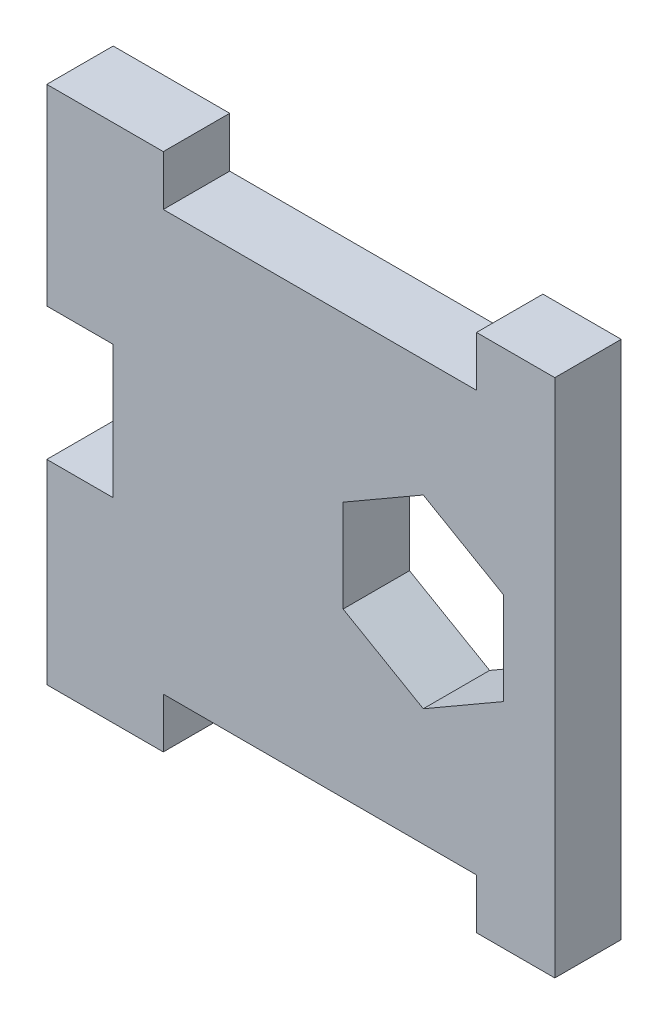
ISO-10303-21;
HEADER;
FILE_DESCRIPTION(('STEP AP214'),'2;1');
FILE_NAME('part.step','',(''),(''),'','','');
FILE_SCHEMA(('AUTOMOTIVE_DESIGN { 1 0 10303 214 1 1 1 1 }'));
ENDSEC;
DATA;
#1=APPLICATION_CONTEXT('core data for automotive mechanical design processes');
#2=APPLICATION_PROTOCOL_DEFINITION('international standard','automotive_design',2000,#1);
#3=PRODUCT_CONTEXT('',#1,'mechanical');
#4=PRODUCT('Part','Part','',(#3));
#5=PRODUCT_RELATED_PRODUCT_CATEGORY('part','',(#4));
#6=PRODUCT_DEFINITION_FORMATION('','',#4);
#7=PRODUCT_DEFINITION_CONTEXT('part definition',#1,'design');
#8=PRODUCT_DEFINITION('design','',#6,#7);
#9=PRODUCT_DEFINITION_SHAPE('','',#8);
#10=(LENGTH_UNIT() NAMED_UNIT(*) SI_UNIT(.MILLI.,.METRE.));
#11=(NAMED_UNIT(*) PLANE_ANGLE_UNIT() SI_UNIT($,.RADIAN.));
#12=(NAMED_UNIT(*) SI_UNIT($,.STERADIAN.) SOLID_ANGLE_UNIT());
#13=UNCERTAINTY_MEASURE_WITH_UNIT(LENGTH_MEASURE(1.E-05),#10,'distance_accuracy_value','');
#14=(GEOMETRIC_REPRESENTATION_CONTEXT(3) GLOBAL_UNCERTAINTY_ASSIGNED_CONTEXT((#13)) GLOBAL_UNIT_ASSIGNED_CONTEXT((#10,
#11,#12)) REPRESENTATION_CONTEXT('',''));
#15=CARTESIAN_POINT('',(0.,0.,0.));
#16=DIRECTION('',(0.,0.,1.));
#17=DIRECTION('',(1.,0.,0.));
#18=AXIS2_PLACEMENT_3D('',#15,#16,#17);
#19=CARTESIAN_POINT('',(0.,-739.302548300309,-1.8126327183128));
#20=DIRECTION('',(0.,1.,0.));
#21=DIRECTION('',(0.,0.,1.));
#22=AXIS2_PLACEMENT_3D('',#19,#20,#21);
#23=PLANE('',#22);
#24=DIRECTION('',(1.,0.,0.));
#25=VECTOR('',#24,1.);
#26=CARTESIAN_POINT('',(0.,-739.302548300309,-7.1974327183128));
#27=LINE('',#26,#25);
#28=CARTESIAN_POINT('',(598.468256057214,-739.302548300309,-7.1974327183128));
#29=VERTEX_POINT('',#28);
#30=CARTESIAN_POINT('',(607.917056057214,-739.302548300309,-7.1974327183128));
#31=VERTEX_POINT('',#30);
#32=EDGE_CURVE('E238',#29,#31,#27,.T.);
#33=ORIENTED_EDGE('',*,*,#32,.T.);
#34=DIRECTION('',(0.,0.,-1.));
#35=VECTOR('',#34,1.);
#36=CARTESIAN_POINT('',(607.917056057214,-739.302548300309,-1.8126327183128));
#37=LINE('',#36,#35);
#38=CARTESIAN_POINT('',(607.917056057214,-739.302548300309,-1.8126327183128));
#39=VERTEX_POINT('',#38);
#40=EDGE_CURVE('E11',#39,#31,#37,.T.);
#41=ORIENTED_EDGE('',*,*,#40,.F.);
#42=DIRECTION('',(1.,0.,0.));
#43=VECTOR('',#42,1.);
#44=CARTESIAN_POINT('',(0.,-739.302548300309,-1.8126327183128));
#45=LINE('',#44,#43);
#46=CARTESIAN_POINT('',(598.468256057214,-739.302548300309,-1.8126327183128));
#47=VERTEX_POINT('',#46);
#48=EDGE_CURVE('E347',#47,#39,#45,.T.);
#49=ORIENTED_EDGE('',*,*,#48,.F.);
#50=DIRECTION('',(0.,0.,-1.));
#51=VECTOR('',#50,1.);
#52=CARTESIAN_POINT('',(598.468256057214,-739.302548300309,-1.8126327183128));
#53=LINE('',#52,#51);
#54=EDGE_CURVE('E273',#47,#29,#53,.T.);
#55=ORIENTED_EDGE('',*,*,#54,.T.);
#56=EDGE_LOOP('',(#33,#41,#49,#55));
#57=FACE_BOUND('',#56,.T.);
#58=ADVANCED_FACE('F34',(#57),#23,.F.);
#59=CARTESIAN_POINT('',(607.917056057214,0.,-1.8126327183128));
#60=DIRECTION('',(-1.,0.,0.));
#61=DIRECTION('',(0.,0.,1.));
#62=AXIS2_PLACEMENT_3D('',#59,#60,#61);
#63=PLANE('',#62);
#64=DIRECTION('',(0.,1.,0.));
#65=VECTOR('',#64,1.);
#66=CARTESIAN_POINT('',(607.917056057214,0.,-7.1974327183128));
#67=LINE('',#66,#65);
#68=CARTESIAN_POINT('',(607.917056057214,-735.238548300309,-7.1974327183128));
#69=VERTEX_POINT('',#68);
#70=EDGE_CURVE('E241',#31,#69,#67,.T.);
#71=ORIENTED_EDGE('',*,*,#70,.T.);
#72=DIRECTION('',(0.,0.,-1.));
#73=VECTOR('',#72,1.);
#74=CARTESIAN_POINT('',(607.917056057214,-735.238548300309,-1.8126327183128));
#75=LINE('',#74,#73);
#76=CARTESIAN_POINT('',(607.917056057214,-735.238548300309,-1.8126327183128));
#77=VERTEX_POINT('',#76);
#78=EDGE_CURVE('E44',#77,#69,#75,.T.);
#79=ORIENTED_EDGE('',*,*,#78,.F.);
#80=DIRECTION('',(0.,1.,0.));
#81=VECTOR('',#80,1.);
#82=CARTESIAN_POINT('',(607.917056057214,0.,-1.8126327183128));
#83=LINE('',#82,#81);
#84=EDGE_CURVE('E349',#39,#77,#83,.T.);
#85=ORIENTED_EDGE('',*,*,#84,.F.);
#86=ORIENTED_EDGE('',*,*,#40,.T.);
#87=EDGE_LOOP('',(#71,#79,#85,#86));
#88=FACE_BOUND('',#87,.T.);
#89=ADVANCED_FACE('F398',(#88),#63,.F.);
#90=CARTESIAN_POINT('',(0.,-735.238548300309,-1.8126327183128));
#91=DIRECTION('',(0.,1.,0.));
#92=DIRECTION('',(0.,0.,1.));
#93=AXIS2_PLACEMENT_3D('',#90,#91,#92);
#94=PLANE('',#93);
#95=DIRECTION('',(1.,0.,0.));
#96=VECTOR('',#95,1.);
#97=CARTESIAN_POINT('',(0.,-735.238548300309,-7.1974327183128));
#98=LINE('',#97,#96);
#99=CARTESIAN_POINT('',(633.317056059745,-735.238548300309,-7.1974327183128));
#100=VERTEX_POINT('',#99);
#101=EDGE_CURVE('E243',#69,#100,#98,.T.);
#102=ORIENTED_EDGE('',*,*,#101,.T.);
#103=DIRECTION('',(0.,0.,-1.));
#104=VECTOR('',#103,1.);
#105=CARTESIAN_POINT('',(633.317056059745,-735.238548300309,-1.8126327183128));
#106=LINE('',#105,#104);
#107=CARTESIAN_POINT('',(633.317056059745,-735.238548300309,-1.8126327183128));
#108=VERTEX_POINT('',#107);
#109=EDGE_CURVE('E301',#108,#100,#106,.T.);
#110=ORIENTED_EDGE('',*,*,#109,.F.);
#111=DIRECTION('',(1.,0.,0.));
#112=VECTOR('',#111,1.);
#113=CARTESIAN_POINT('',(0.,-735.238548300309,-1.8126327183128));
#114=LINE('',#113,#112);
#115=EDGE_CURVE('E351',#77,#108,#114,.T.);
#116=ORIENTED_EDGE('',*,*,#115,.F.);
#117=ORIENTED_EDGE('',*,*,#78,.T.);
#118=EDGE_LOOP('',(#102,#110,#116,#117));
#119=FACE_BOUND('',#118,.T.);
#120=ADVANCED_FACE('F403',(#119),#94,.F.);
#121=CARTESIAN_POINT('',(633.317056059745,0.,-1.8126327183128));
#122=DIRECTION('',(1.,0.,0.));
#123=DIRECTION('',(0.,0.,-1.));
#124=AXIS2_PLACEMENT_3D('',#121,#122,#123);
#125=PLANE('',#124);
#126=DIRECTION('',(0.,-1.,0.));
#127=VECTOR('',#126,1.);
#128=CARTESIAN_POINT('',(633.317056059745,0.,-7.1974327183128));
#129=LINE('',#128,#127);
#130=CARTESIAN_POINT('',(633.317056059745,-739.302548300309,-7.1974327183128));
#131=VERTEX_POINT('',#130);
#132=EDGE_CURVE('E245',#100,#131,#129,.T.);
#133=ORIENTED_EDGE('',*,*,#132,.T.);
#134=DIRECTION('',(0.,0.,-1.));
#135=VECTOR('',#134,1.);
#136=CARTESIAN_POINT('',(633.317056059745,-739.302548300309,-1.8126327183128));
#137=LINE('',#136,#135);
#138=CARTESIAN_POINT('',(633.317056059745,-739.302548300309,-1.8126327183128));
#139=VERTEX_POINT('',#138);
#140=EDGE_CURVE('E298',#139,#131,#137,.T.);
#141=ORIENTED_EDGE('',*,*,#140,.F.);
#142=DIRECTION('',(0.,-1.,0.));
#143=VECTOR('',#142,1.);
#144=CARTESIAN_POINT('',(633.317056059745,0.,-1.8126327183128));
#145=LINE('',#144,#143);
#146=EDGE_CURVE('E353',#108,#139,#145,.T.);
#147=ORIENTED_EDGE('',*,*,#146,.F.);
#148=ORIENTED_EDGE('',*,*,#109,.T.);
#149=EDGE_LOOP('',(#133,#141,#147,#148));
#150=FACE_BOUND('',#149,.T.);
#151=ADVANCED_FACE('F457',(#150),#125,.F.);
#152=CARTESIAN_POINT('',(0.,-739.302548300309,-1.8126327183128));
#153=DIRECTION('',(0.,1.,0.));
#154=DIRECTION('',(0.,0.,1.));
#155=AXIS2_PLACEMENT_3D('',#152,#153,#154);
#156=PLANE('',#155);
#157=DIRECTION('',(1.,0.,0.));
#158=VECTOR('',#157,1.);
#159=CARTESIAN_POINT('',(0.,-739.302548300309,-7.1974327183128));
#160=LINE('',#159,#158);
#161=CARTESIAN_POINT('',(639.667056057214,-739.302548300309,-7.1974327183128));
#162=VERTEX_POINT('',#161);
#163=EDGE_CURVE('E247',#131,#162,#160,.T.);
#164=ORIENTED_EDGE('',*,*,#163,.T.);
#165=DIRECTION('',(0.,0.,-1.));
#166=VECTOR('',#165,1.);
#167=CARTESIAN_POINT('',(639.667056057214,-739.302548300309,-1.8126327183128));
#168=LINE('',#167,#166);
#169=CARTESIAN_POINT('',(639.667056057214,-739.302548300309,-1.8126327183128));
#170=VERTEX_POINT('',#169);
#171=EDGE_CURVE('E295',#170,#162,#168,.T.);
#172=ORIENTED_EDGE('',*,*,#171,.F.);
#173=DIRECTION('',(1.,0.,0.));
#174=VECTOR('',#173,1.);
#175=CARTESIAN_POINT('',(0.,-739.302548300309,-1.8126327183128));
#176=LINE('',#175,#174);
#177=EDGE_CURVE('E355',#139,#170,#176,.T.);
#178=ORIENTED_EDGE('',*,*,#177,.F.);
#179=ORIENTED_EDGE('',*,*,#140,.T.);
#180=EDGE_LOOP('',(#164,#172,#178,#179));
#181=FACE_BOUND('',#180,.T.);
#182=ADVANCED_FACE('F453',(#181),#156,.F.);
#183=CARTESIAN_POINT('',(639.667056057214,0.,-1.8126327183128));
#184=DIRECTION('',(-1.,0.,0.));
#185=DIRECTION('',(0.,0.,1.));
#186=AXIS2_PLACEMENT_3D('',#183,#184,#185);
#187=PLANE('',#186);
#188=DIRECTION('',(0.,1.,0.));
#189=VECTOR('',#188,1.);
#190=CARTESIAN_POINT('',(639.667056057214,0.,-7.1974327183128));
#191=LINE('',#190,#189);
#192=CARTESIAN_POINT('',(639.667056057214,-697.138548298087,-7.1974327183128));
#193=VERTEX_POINT('',#192);
#194=EDGE_CURVE('E249',#162,#193,#191,.T.);
#195=ORIENTED_EDGE('',*,*,#194,.T.);
#196=DIRECTION('',(0.,0.,-1.));
#197=VECTOR('',#196,1.);
#198=CARTESIAN_POINT('',(639.667056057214,-697.138548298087,-1.8126327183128));
#199=LINE('',#198,#197);
#200=CARTESIAN_POINT('',(639.667056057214,-697.138548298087,-1.8126327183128));
#201=VERTEX_POINT('',#200);
#202=EDGE_CURVE('E292',#201,#193,#199,.T.);
#203=ORIENTED_EDGE('',*,*,#202,.F.);
#204=DIRECTION('',(0.,1.,0.));
#205=VECTOR('',#204,1.);
#206=CARTESIAN_POINT('',(639.667056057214,0.,-1.8126327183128));
#207=LINE('',#206,#205);
#208=EDGE_CURVE('E357',#170,#201,#207,.T.);
#209=ORIENTED_EDGE('',*,*,#208,.F.);
#210=ORIENTED_EDGE('',*,*,#171,.T.);
#211=EDGE_LOOP('',(#195,#203,#209,#210));
#212=FACE_BOUND('',#211,.T.);
#213=ADVANCED_FACE('F449',(#212),#187,.F.);
#214=CARTESIAN_POINT('',(0.,-697.138548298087,-1.8126327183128));
#215=DIRECTION('',(0.,-1.,0.));
#216=DIRECTION('',(0.,0.,-1.));
#217=AXIS2_PLACEMENT_3D('',#214,#215,#216);
#218=PLANE('',#217);
#219=DIRECTION('',(-1.,0.,0.));
#220=VECTOR('',#219,1.);
#221=CARTESIAN_POINT('',(0.,-697.138548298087,-7.1974327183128));
#222=LINE('',#221,#220);
#223=CARTESIAN_POINT('',(633.317056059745,-697.138548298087,-7.1974327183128));
#224=VERTEX_POINT('',#223);
#225=EDGE_CURVE('E251',#193,#224,#222,.T.);
#226=ORIENTED_EDGE('',*,*,#225,.T.);
#227=DIRECTION('',(0.,0.,-1.));
#228=VECTOR('',#227,1.);
#229=CARTESIAN_POINT('',(633.317056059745,-697.138548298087,-1.8126327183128));
#230=LINE('',#229,#228);
#231=CARTESIAN_POINT('',(633.317056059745,-697.138548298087,-1.8126327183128));
#232=VERTEX_POINT('',#231);
#233=EDGE_CURVE('E289',#232,#224,#230,.T.);
#234=ORIENTED_EDGE('',*,*,#233,.F.);
#235=DIRECTION('',(-1.,0.,0.));
#236=VECTOR('',#235,1.);
#237=CARTESIAN_POINT('',(0.,-697.138548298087,-1.8126327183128));
#238=LINE('',#237,#236);
#239=EDGE_CURVE('E359',#201,#232,#238,.T.);
#240=ORIENTED_EDGE('',*,*,#239,.F.);
#241=ORIENTED_EDGE('',*,*,#202,.T.);
#242=EDGE_LOOP('',(#226,#234,#240,#241));
#243=FACE_BOUND('',#242,.T.);
#244=ADVANCED_FACE('F445',(#243),#218,.F.);
#245=CARTESIAN_POINT('',(633.317056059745,0.,-1.8126327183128));
#246=DIRECTION('',(1.,0.,0.));
#247=DIRECTION('',(0.,0.,-1.));
#248=AXIS2_PLACEMENT_3D('',#245,#246,#247);
#249=PLANE('',#248);
#250=DIRECTION('',(0.,-1.,0.));
#251=VECTOR('',#250,1.);
#252=CARTESIAN_POINT('',(633.317056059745,0.,-7.1974327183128));
#253=LINE('',#252,#251);
#254=CARTESIAN_POINT('',(633.317056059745,-701.202548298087,-7.1974327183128));
#255=VERTEX_POINT('',#254);
#256=EDGE_CURVE('E253',#224,#255,#253,.T.);
#257=ORIENTED_EDGE('',*,*,#256,.T.);
#258=DIRECTION('',(0.,0.,-1.));
#259=VECTOR('',#258,1.);
#260=CARTESIAN_POINT('',(633.317056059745,-701.202548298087,-1.8126327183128));
#261=LINE('',#260,#259);
#262=CARTESIAN_POINT('',(633.317056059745,-701.202548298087,-1.8126327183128));
#263=VERTEX_POINT('',#262);
#264=EDGE_CURVE('E286',#263,#255,#261,.T.);
#265=ORIENTED_EDGE('',*,*,#264,.F.);
#266=DIRECTION('',(0.,-1.,0.));
#267=VECTOR('',#266,1.);
#268=CARTESIAN_POINT('',(633.317056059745,0.,-1.8126327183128));
#269=LINE('',#268,#267);
#270=EDGE_CURVE('E361',#232,#263,#269,.T.);
#271=ORIENTED_EDGE('',*,*,#270,.F.);
#272=ORIENTED_EDGE('',*,*,#233,.T.);
#273=EDGE_LOOP('',(#257,#265,#271,#272));
#274=FACE_BOUND('',#273,.T.);
#275=ADVANCED_FACE('F441',(#274),#249,.F.);
#276=CARTESIAN_POINT('',(0.,-701.202548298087,-1.8126327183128));
#277=DIRECTION('',(0.,-1.,0.));
#278=DIRECTION('',(0.,0.,-1.));
#279=AXIS2_PLACEMENT_3D('',#276,#277,#278);
#280=PLANE('',#279);
#281=DIRECTION('',(-1.,0.,0.));
#282=VECTOR('',#281,1.);
#283=CARTESIAN_POINT('',(0.,-701.202548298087,-7.1974327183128));
#284=LINE('',#283,#282);
#285=CARTESIAN_POINT('',(607.917056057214,-701.202548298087,-7.1974327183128));
#286=VERTEX_POINT('',#285);
#287=EDGE_CURVE('E255',#255,#286,#284,.T.);
#288=ORIENTED_EDGE('',*,*,#287,.T.);
#289=DIRECTION('',(0.,0.,-1.));
#290=VECTOR('',#289,1.);
#291=CARTESIAN_POINT('',(607.917056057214,-701.202548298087,-1.8126327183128));
#292=LINE('',#291,#290);
#293=CARTESIAN_POINT('',(607.917056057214,-701.202548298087,-1.8126327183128));
#294=VERTEX_POINT('',#293);
#295=EDGE_CURVE('E283',#294,#286,#292,.T.);
#296=ORIENTED_EDGE('',*,*,#295,.F.);
#297=DIRECTION('',(-1.,0.,0.));
#298=VECTOR('',#297,1.);
#299=CARTESIAN_POINT('',(0.,-701.202548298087,-1.8126327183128));
#300=LINE('',#299,#298);
#301=EDGE_CURVE('E363',#263,#294,#300,.T.);
#302=ORIENTED_EDGE('',*,*,#301,.F.);
#303=ORIENTED_EDGE('',*,*,#264,.T.);
#304=EDGE_LOOP('',(#288,#296,#302,#303));
#305=FACE_BOUND('',#304,.T.);
#306=ADVANCED_FACE('F437',(#305),#280,.F.);
#307=CARTESIAN_POINT('',(607.917056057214,0.,-1.8126327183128));
#308=DIRECTION('',(-1.,0.,0.));
#309=DIRECTION('',(0.,0.,1.));
#310=AXIS2_PLACEMENT_3D('',#307,#308,#309);
#311=PLANE('',#310);
#312=DIRECTION('',(0.,1.,0.));
#313=VECTOR('',#312,1.);
#314=CARTESIAN_POINT('',(607.917056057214,0.,-7.1974327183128));
#315=LINE('',#314,#313);
#316=CARTESIAN_POINT('',(607.917056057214,-697.138548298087,-7.1974327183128));
#317=VERTEX_POINT('',#316);
#318=EDGE_CURVE('E257',#286,#317,#315,.T.);
#319=ORIENTED_EDGE('',*,*,#318,.T.);
#320=DIRECTION('',(0.,0.,-1.));
#321=VECTOR('',#320,1.);
#322=CARTESIAN_POINT('',(607.917056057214,-697.138548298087,-1.8126327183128));
#323=LINE('',#322,#321);
#324=CARTESIAN_POINT('',(607.917056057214,-697.138548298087,-1.8126327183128));
#325=VERTEX_POINT('',#324);
#326=EDGE_CURVE('E281',#325,#317,#323,.T.);
#327=ORIENTED_EDGE('',*,*,#326,.F.);
#328=DIRECTION('',(0.,1.,0.));
#329=VECTOR('',#328,1.);
#330=CARTESIAN_POINT('',(607.917056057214,0.,-1.8126327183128));
#331=LINE('',#330,#329);
#332=EDGE_CURVE('E365',#294,#325,#331,.T.);
#333=ORIENTED_EDGE('',*,*,#332,.F.);
#334=ORIENTED_EDGE('',*,*,#295,.T.);
#335=EDGE_LOOP('',(#319,#327,#333,#334));
#336=FACE_BOUND('',#335,.T.);
#337=ADVANCED_FACE('F433',(#336),#311,.F.);
#338=CARTESIAN_POINT('',(-1.96591127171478E-10,-697.138548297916,-1.8126327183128));
#339=DIRECTION('',(2.81997212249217E-13,1.,0.));
#340=DIRECTION('',(-1.,2.81997212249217E-13,0.));
#341=AXIS2_PLACEMENT_3D('',#338,#339,#340);
#342=PLANE('',#341);
#343=DIRECTION('',(1.,-2.81997212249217E-13,0.));
#344=VECTOR('',#343,1.);
#345=CARTESIAN_POINT('',(-1.96591127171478E-10,-697.138548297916,-7.1974327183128));
#346=LINE('',#345,#344);
#347=CARTESIAN_POINT('',(598.468256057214,-697.138548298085,-7.1974327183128));
#348=VERTEX_POINT('',#347);
#349=EDGE_CURVE('E260',#348,#317,#346,.T.);
#350=ORIENTED_EDGE('',*,*,#349,.F.);
#351=DIRECTION('',(0.,0.,-1.));
#352=VECTOR('',#351,1.);
#353=CARTESIAN_POINT('',(598.468256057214,-697.138548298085,-1.8126327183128));
#354=LINE('',#353,#352);
#355=CARTESIAN_POINT('',(598.468256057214,-697.138548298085,-1.8126327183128));
#356=VERTEX_POINT('',#355);
#357=EDGE_CURVE('E279',#356,#348,#354,.T.);
#358=ORIENTED_EDGE('',*,*,#357,.F.);
#359=DIRECTION('',(1.,-2.81997212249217E-13,0.));
#360=VECTOR('',#359,1.);
#361=CARTESIAN_POINT('',(-1.96591127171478E-10,-697.138548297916,-1.8126327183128));
#362=LINE('',#361,#360);
#363=EDGE_CURVE('E367',#356,#325,#362,.T.);
#364=ORIENTED_EDGE('',*,*,#363,.T.);
#365=ORIENTED_EDGE('',*,*,#326,.T.);
#366=EDGE_LOOP('',(#350,#358,#364,#365));
#367=FACE_BOUND('',#366,.T.);
#368=ADVANCED_FACE('F430',(#367),#342,.T.);
#369=CARTESIAN_POINT('',(598.468256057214,0.,-1.8126327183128));
#370=DIRECTION('',(-1.,0.,0.));
#371=DIRECTION('',(0.,0.,1.));
#372=AXIS2_PLACEMENT_3D('',#369,#370,#371);
#373=PLANE('',#372);
#374=DIRECTION('',(0.,1.,0.));
#375=VECTOR('',#374,1.);
#376=CARTESIAN_POINT('',(598.468256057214,0.,-7.1974327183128));
#377=LINE('',#376,#375);
#378=CARTESIAN_POINT('',(598.468256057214,-712.70874829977,-7.1974327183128));
#379=VERTEX_POINT('',#378);
#380=EDGE_CURVE('E263',#379,#348,#377,.T.);
#381=ORIENTED_EDGE('',*,*,#380,.F.);
#382=DIRECTION('',(0.,0.,-1.));
#383=VECTOR('',#382,1.);
#384=CARTESIAN_POINT('',(598.468256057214,-712.70874829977,-1.8126327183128));
#385=LINE('',#384,#383);
#386=CARTESIAN_POINT('',(598.468256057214,-712.70874829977,-1.8126327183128));
#387=VERTEX_POINT('',#386);
#388=EDGE_CURVE('E277',#387,#379,#385,.T.);
#389=ORIENTED_EDGE('',*,*,#388,.F.);
#390=DIRECTION('',(0.,1.,0.));
#391=VECTOR('',#390,1.);
#392=CARTESIAN_POINT('',(598.468256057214,0.,-1.8126327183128));
#393=LINE('',#392,#391);
#394=EDGE_CURVE('E214',#387,#356,#393,.T.);
#395=ORIENTED_EDGE('',*,*,#394,.T.);
#396=ORIENTED_EDGE('',*,*,#357,.T.);
#397=EDGE_LOOP('',(#381,#389,#395,#396));
#398=FACE_BOUND('',#397,.T.);
#399=ADVANCED_FACE('F372',(#398),#373,.T.);
#400=CARTESIAN_POINT('',(0.,-712.70874829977,-1.8126327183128));
#401=DIRECTION('',(0.,-1.,0.));
#402=DIRECTION('',(0.,0.,-1.));
#403=AXIS2_PLACEMENT_3D('',#400,#401,#402);
#404=PLANE('',#403);
#405=DIRECTION('',(-1.,0.,0.));
#406=VECTOR('',#405,1.);
#407=CARTESIAN_POINT('',(0.,-712.70874829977,-7.1974327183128));
#408=LINE('',#407,#406);
#409=CARTESIAN_POINT('',(603.853056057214,-712.70874829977,-7.1974327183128));
#410=VERTEX_POINT('',#409);
#411=EDGE_CURVE('E266',#410,#379,#408,.T.);
#412=ORIENTED_EDGE('',*,*,#411,.F.);
#413=DIRECTION('',(0.,0.,-1.));
#414=VECTOR('',#413,1.);
#415=CARTESIAN_POINT('',(603.853056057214,-712.70874829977,-1.8126327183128));
#416=LINE('',#415,#414);
#417=CARTESIAN_POINT('',(603.853056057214,-712.70874829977,-1.8126327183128));
#418=VERTEX_POINT('',#417);
#419=EDGE_CURVE('E202',#418,#410,#416,.T.);
#420=ORIENTED_EDGE('',*,*,#419,.F.);
#421=DIRECTION('',(-1.,0.,0.));
#422=VECTOR('',#421,1.);
#423=CARTESIAN_POINT('',(0.,-712.70874829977,-1.8126327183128));
#424=LINE('',#423,#422);
#425=EDGE_CURVE('E212',#418,#387,#424,.T.);
#426=ORIENTED_EDGE('',*,*,#425,.T.);
#427=ORIENTED_EDGE('',*,*,#388,.T.);
#428=EDGE_LOOP('',(#412,#420,#426,#427));
#429=FACE_BOUND('',#428,.T.);
#430=ADVANCED_FACE('F377',(#429),#404,.T.);
#431=CARTESIAN_POINT('',(603.853056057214,0.,-1.8126327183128));
#432=DIRECTION('',(-1.,0.,0.));
#433=DIRECTION('',(0.,0.,1.));
#434=AXIS2_PLACEMENT_3D('',#431,#432,#433);
#435=PLANE('',#434);
#436=DIRECTION('',(0.,1.,0.));
#437=VECTOR('',#436,1.);
#438=CARTESIAN_POINT('',(603.853056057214,0.,-7.1974327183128));
#439=LINE('',#438,#437);
#440=CARTESIAN_POINT('',(603.853056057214,-723.47834829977,-7.1974327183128));
#441=VERTEX_POINT('',#440);
#442=EDGE_CURVE('E201',#441,#410,#439,.T.);
#443=ORIENTED_EDGE('',*,*,#442,.F.);
#444=DIRECTION('',(0.,0.,-1.));
#445=VECTOR('',#444,1.);
#446=CARTESIAN_POINT('',(603.853056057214,-723.47834829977,-1.8126327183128));
#447=LINE('',#446,#445);
#448=CARTESIAN_POINT('',(603.853056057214,-723.47834829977,-1.8126327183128));
#449=VERTEX_POINT('',#448);
#450=EDGE_CURVE('E195',#449,#441,#447,.T.);
#451=ORIENTED_EDGE('',*,*,#450,.F.);
#452=DIRECTION('',(0.,1.,0.));
#453=VECTOR('',#452,1.);
#454=CARTESIAN_POINT('',(603.853056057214,0.,-1.8126327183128));
#455=LINE('',#454,#453);
#456=EDGE_CURVE('E199',#449,#418,#455,.T.);
#457=ORIENTED_EDGE('',*,*,#456,.T.);
#458=ORIENTED_EDGE('',*,*,#419,.T.);
#459=EDGE_LOOP('',(#443,#451,#457,#458));
#460=FACE_BOUND('',#459,.T.);
#461=ADVANCED_FACE('F197',(#460),#435,.T.);
#462=CARTESIAN_POINT('',(0.,-723.47834829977,-1.8126327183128));
#463=DIRECTION('',(0.,-1.,0.));
#464=DIRECTION('',(0.,0.,-1.));
#465=AXIS2_PLACEMENT_3D('',#462,#463,#464);
#466=PLANE('',#465);
#467=DIRECTION('',(-1.,0.,0.));
#468=VECTOR('',#467,1.);
#469=CARTESIAN_POINT('',(0.,-723.47834829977,-7.1974327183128));
#470=LINE('',#469,#468);
#471=CARTESIAN_POINT('',(598.468256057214,-723.47834829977,-7.1974327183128));
#472=VERTEX_POINT('',#471);
#473=EDGE_CURVE('E123',#441,#472,#470,.T.);
#474=ORIENTED_EDGE('',*,*,#473,.T.);
#475=DIRECTION('',(0.,0.,-1.));
#476=VECTOR('',#475,1.);
#477=CARTESIAN_POINT('',(598.468256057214,-723.47834829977,-1.8126327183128));
#478=LINE('',#477,#476);
#479=CARTESIAN_POINT('',(598.468256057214,-723.47834829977,-1.8126327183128));
#480=VERTEX_POINT('',#479);
#481=EDGE_CURVE('E203',#480,#472,#478,.T.);
#482=ORIENTED_EDGE('',*,*,#481,.F.);
#483=DIRECTION('',(-1.,0.,0.));
#484=VECTOR('',#483,1.);
#485=CARTESIAN_POINT('',(0.,-723.47834829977,-1.8126327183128));
#486=LINE('',#485,#484);
#487=EDGE_CURVE('E205',#449,#480,#486,.T.);
#488=ORIENTED_EDGE('',*,*,#487,.F.);
#489=ORIENTED_EDGE('',*,*,#450,.T.);
#490=EDGE_LOOP('',(#474,#482,#488,#489));
#491=FACE_BOUND('',#490,.T.);
#492=ADVANCED_FACE('F206',(#491),#466,.F.);
#493=CARTESIAN_POINT('',(471.498384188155,-816.659157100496,-1.8126327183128));
#494=DIRECTION('',(-0.500000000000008,0.866025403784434,0.));
#495=DIRECTION('',(-0.866025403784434,-0.500000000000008,0.));
#496=AXIS2_PLACEMENT_3D('',#493,#494,#495);
#497=PLANE('',#496);
#498=DIRECTION('',(0.866025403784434,0.500000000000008,0.));
#499=VECTOR('',#498,1.);
#500=CARTESIAN_POINT('',(471.498384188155,-816.659157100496,-7.1974327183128));
#501=LINE('',#500,#499);
#502=CARTESIAN_POINT('',(628.999056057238,-725.726101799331,-7.1974327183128));
#503=VERTEX_POINT('',#502);
#504=CARTESIAN_POINT('',(635.499056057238,-721.973325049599,-7.1974327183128));
#505=VERTEX_POINT('',#504);
#506=EDGE_CURVE('E220',#503,#505,#501,.T.);
#507=ORIENTED_EDGE('',*,*,#506,.F.);
#508=DIRECTION('',(0.,0.,-1.));
#509=VECTOR('',#508,1.);
#510=CARTESIAN_POINT('',(628.999056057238,-725.726101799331,-1.8126327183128));
#511=LINE('',#510,#509);
#512=CARTESIAN_POINT('',(628.999056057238,-725.726101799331,-1.8126327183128));
#513=VERTEX_POINT('',#512);
#514=EDGE_CURVE('E38',#513,#503,#511,.T.);
#515=ORIENTED_EDGE('',*,*,#514,.F.);
#516=DIRECTION('',(0.866025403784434,0.500000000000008,0.));
#517=VECTOR('',#516,1.);
#518=CARTESIAN_POINT('',(471.498384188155,-816.659157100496,-1.8126327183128));
#519=LINE('',#518,#517);
#520=CARTESIAN_POINT('',(635.499056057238,-721.973325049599,-1.8126327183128));
#521=VERTEX_POINT('',#520);
#522=EDGE_CURVE('E272',#513,#521,#519,.T.);
#523=ORIENTED_EDGE('',*,*,#522,.T.);
#524=DIRECTION('',(0.,0.,-1.));
#525=VECTOR('',#524,1.);
#526=CARTESIAN_POINT('',(635.499056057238,-721.973325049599,-1.8126327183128));
#527=LINE('',#526,#525);
#528=EDGE_CURVE('E219',#521,#505,#527,.T.);
#529=ORIENTED_EDGE('',*,*,#528,.T.);
#530=EDGE_LOOP('',(#507,#515,#523,#529));
#531=FACE_BOUND('',#530,.T.);
#532=ADVANCED_FACE('F36',(#531),#497,.T.);
#533=CARTESIAN_POINT('',(-156.998856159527,-271.929995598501,-1.8126327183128));
#534=DIRECTION('',(0.499999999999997,0.86602540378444,0.));
#535=DIRECTION('',(-0.86602540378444,0.499999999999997,0.));
#536=AXIS2_PLACEMENT_3D('',#533,#534,#535);
#537=PLANE('',#536);
#538=DIRECTION('',(0.86602540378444,-0.499999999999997,0.));
#539=VECTOR('',#538,1.);
#540=CARTESIAN_POINT('',(-156.998856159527,-271.929995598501,-7.1974327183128));
#541=LINE('',#540,#539);
#542=CARTESIAN_POINT('',(622.499056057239,-721.973325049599,-7.1974327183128));
#543=VERTEX_POINT('',#542);
#544=EDGE_CURVE('E223',#543,#503,#541,.T.);
#545=ORIENTED_EDGE('',*,*,#544,.F.);
#546=DIRECTION('',(0.,0.,-1.));
#547=VECTOR('',#546,1.);
#548=CARTESIAN_POINT('',(622.499056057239,-721.973325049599,-1.8126327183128));
#549=LINE('',#548,#547);
#550=CARTESIAN_POINT('',(622.499056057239,-721.973325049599,-1.8126327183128));
#551=VERTEX_POINT('',#550);
#552=EDGE_CURVE('E312',#551,#543,#549,.T.);
#553=ORIENTED_EDGE('',*,*,#552,.F.);
#554=DIRECTION('',(0.86602540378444,-0.499999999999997,0.));
#555=VECTOR('',#554,1.);
#556=CARTESIAN_POINT('',(-156.998856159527,-271.929995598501,-1.8126327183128));
#557=LINE('',#556,#555);
#558=EDGE_CURVE('E321',#551,#513,#557,.T.);
#559=ORIENTED_EDGE('',*,*,#558,.T.);
#560=ORIENTED_EDGE('',*,*,#514,.T.);
#561=EDGE_LOOP('',(#545,#553,#559,#560));
#562=FACE_BOUND('',#561,.T.);
#563=ADVANCED_FACE('F319',(#562),#537,.T.);
#564=CARTESIAN_POINT('',(622.499056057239,0.,-1.8126327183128));
#565=DIRECTION('',(1.,0.,0.));
#566=DIRECTION('',(0.,0.,-1.));
#567=AXIS2_PLACEMENT_3D('',#564,#565,#566);
#568=PLANE('',#567);
#569=DIRECTION('',(0.,-1.,0.));
#570=VECTOR('',#569,1.);
#571=CARTESIAN_POINT('',(622.499056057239,0.,-7.1974327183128));
#572=LINE('',#571,#570);
#573=CARTESIAN_POINT('',(622.499056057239,-714.467771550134,-7.1974327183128));
#574=VERTEX_POINT('',#573);
#575=EDGE_CURVE('E226',#574,#543,#572,.T.);
#576=ORIENTED_EDGE('',*,*,#575,.F.);
#577=DIRECTION('',(0.,0.,-1.));
#578=VECTOR('',#577,1.);
#579=CARTESIAN_POINT('',(622.499056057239,-714.467771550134,-1.8126327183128));
#580=LINE('',#579,#578);
#581=CARTESIAN_POINT('',(622.499056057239,-714.467771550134,-1.8126327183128));
#582=VERTEX_POINT('',#581);
#583=EDGE_CURVE('E311',#582,#574,#580,.T.);
#584=ORIENTED_EDGE('',*,*,#583,.F.);
#585=DIRECTION('',(0.,-1.,0.));
#586=VECTOR('',#585,1.);
#587=CARTESIAN_POINT('',(622.499056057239,0.,-1.8126327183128));
#588=LINE('',#587,#586);
#589=EDGE_CURVE('E329',#582,#551,#588,.T.);
#590=ORIENTED_EDGE('',*,*,#589,.T.);
#591=ORIENTED_EDGE('',*,*,#552,.T.);
#592=EDGE_LOOP('',(#576,#584,#590,#591));
#593=FACE_BOUND('',#592,.T.);
#594=ADVANCED_FACE('F327',(#593),#568,.T.);
#595=CARTESIAN_POINT('',(464.998384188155,-805.400826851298,-1.8126327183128));
#596=DIRECTION('',(0.500000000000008,-0.866025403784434,0.));
#597=DIRECTION('',(0.866025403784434,0.500000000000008,0.));
#598=AXIS2_PLACEMENT_3D('',#595,#596,#597);
#599=PLANE('',#598);
#600=DIRECTION('',(-0.866025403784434,-0.500000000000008,0.));
#601=VECTOR('',#600,1.);
#602=CARTESIAN_POINT('',(464.998384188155,-805.400826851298,-7.1974327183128));
#603=LINE('',#602,#601);
#604=CARTESIAN_POINT('',(628.999056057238,-710.714994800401,-7.1974327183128));
#605=VERTEX_POINT('',#604);
#606=EDGE_CURVE('E229',#605,#574,#603,.T.);
#607=ORIENTED_EDGE('',*,*,#606,.F.);
#608=DIRECTION('',(0.,0.,-1.));
#609=VECTOR('',#608,1.);
#610=CARTESIAN_POINT('',(628.999056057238,-710.714994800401,-1.8126327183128));
#611=LINE('',#610,#609);
#612=CARTESIAN_POINT('',(628.999056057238,-710.714994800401,-1.8126327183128));
#613=VERTEX_POINT('',#612);
#614=EDGE_CURVE('E309',#613,#605,#611,.T.);
#615=ORIENTED_EDGE('',*,*,#614,.F.);
#616=DIRECTION('',(-0.866025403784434,-0.500000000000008,0.));
#617=VECTOR('',#616,1.);
#618=CARTESIAN_POINT('',(464.998384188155,-805.400826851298,-1.8126327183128));
#619=LINE('',#618,#617);
#620=EDGE_CURVE('E335',#613,#582,#619,.T.);
#621=ORIENTED_EDGE('',*,*,#620,.T.);
#622=ORIENTED_EDGE('',*,*,#583,.T.);
#623=EDGE_LOOP('',(#607,#615,#621,#622));
#624=FACE_BOUND('',#623,.T.);
#625=ADVANCED_FACE('F338',(#624),#599,.T.);
#626=CARTESIAN_POINT('',(-150.498856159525,-260.671665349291,-1.8126327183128));
#627=DIRECTION('',(-0.500000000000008,-0.866025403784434,0.));
#628=DIRECTION('',(0.866025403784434,-0.500000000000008,0.));
#629=AXIS2_PLACEMENT_3D('',#626,#627,#628);
#630=PLANE('',#629);
#631=DIRECTION('',(-0.866025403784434,0.500000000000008,0.));
#632=VECTOR('',#631,1.);
#633=CARTESIAN_POINT('',(-150.498856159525,-260.671665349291,-7.1974327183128));
#634=LINE('',#633,#632);
#635=CARTESIAN_POINT('',(635.499056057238,-714.467771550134,-7.1974327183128));
#636=VERTEX_POINT('',#635);
#637=EDGE_CURVE('E232',#636,#605,#634,.T.);
#638=ORIENTED_EDGE('',*,*,#637,.F.);
#639=DIRECTION('',(0.,0.,-1.));
#640=VECTOR('',#639,1.);
#641=CARTESIAN_POINT('',(635.499056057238,-714.467771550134,-1.8126327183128));
#642=LINE('',#641,#640);
#643=CARTESIAN_POINT('',(635.499056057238,-714.467771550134,-1.8126327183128));
#644=VERTEX_POINT('',#643);
#645=EDGE_CURVE('E307',#644,#636,#642,.T.);
#646=ORIENTED_EDGE('',*,*,#645,.F.);
#647=DIRECTION('',(-0.866025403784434,0.500000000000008,0.));
#648=VECTOR('',#647,1.);
#649=CARTESIAN_POINT('',(-150.498856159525,-260.671665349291,-1.8126327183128));
#650=LINE('',#649,#648);
#651=EDGE_CURVE('E339',#644,#613,#650,.T.);
#652=ORIENTED_EDGE('',*,*,#651,.T.);
#653=ORIENTED_EDGE('',*,*,#614,.T.);
#654=EDGE_LOOP('',(#638,#646,#652,#653));
#655=FACE_BOUND('',#654,.T.);
#656=ADVANCED_FACE('F392',(#655),#630,.T.);
#657=CARTESIAN_POINT('',(635.499056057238,0.,-1.8126327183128));
#658=DIRECTION('',(-1.,0.,0.));
#659=DIRECTION('',(0.,0.,1.));
#660=AXIS2_PLACEMENT_3D('',#657,#658,#659);
#661=PLANE('',#660);
#662=DIRECTION('',(0.,1.,0.));
#663=VECTOR('',#662,1.);
#664=CARTESIAN_POINT('',(635.499056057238,0.,-7.1974327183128));
#665=LINE('',#664,#663);
#666=EDGE_CURVE('E235',#505,#636,#665,.T.);
#667=ORIENTED_EDGE('',*,*,#666,.F.);
#668=ORIENTED_EDGE('',*,*,#528,.F.);
#669=DIRECTION('',(0.,1.,0.));
#670=VECTOR('',#669,1.);
#671=CARTESIAN_POINT('',(635.499056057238,0.,-1.8126327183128));
#672=LINE('',#671,#670);
#673=EDGE_CURVE('E341',#521,#644,#672,.T.);
#674=ORIENTED_EDGE('',*,*,#673,.T.);
#675=ORIENTED_EDGE('',*,*,#645,.T.);
#676=EDGE_LOOP('',(#667,#668,#674,#675));
#677=FACE_BOUND('',#676,.T.);
#678=ADVANCED_FACE('F385',(#677),#661,.T.);
#679=CARTESIAN_POINT('',(598.468256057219,-4.19884251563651E-12,-1.8126327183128));
#680=DIRECTION('',(1.,0.,0.));
#681=DIRECTION('',(0.,1.,0.));
#682=AXIS2_PLACEMENT_3D('',#679,#680,#681);
#683=PLANE('',#682);
#684=DIRECTION('',(0.,-1.,0.));
#685=VECTOR('',#684,1.);
#686=CARTESIAN_POINT('',(598.468256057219,-4.19884251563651E-12,-7.1974327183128));
#687=LINE('',#686,#685);
#688=EDGE_CURVE('E129',#472,#29,#687,.T.);
#689=ORIENTED_EDGE('',*,*,#688,.T.);
#690=ORIENTED_EDGE('',*,*,#54,.F.);
#691=DIRECTION('',(0.,-1.,0.));
#692=VECTOR('',#691,1.);
#693=CARTESIAN_POINT('',(598.468256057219,-4.19884251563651E-12,-1.8126327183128));
#694=LINE('',#693,#692);
#695=EDGE_CURVE('E53',#480,#47,#694,.T.);
#696=ORIENTED_EDGE('',*,*,#695,.F.);
#697=ORIENTED_EDGE('',*,*,#481,.T.);
#698=EDGE_LOOP('',(#689,#690,#696,#697));
#699=FACE_BOUND('',#698,.T.);
#700=ADVANCED_FACE('F383',(#699),#683,.F.);
#701=CARTESIAN_POINT('',(0.,0.,-1.8126327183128));
#702=DIRECTION('',(0.,0.,1.));
#703=DIRECTION('',(1.,0.,0.));
#704=AXIS2_PLACEMENT_3D('',#701,#702,#703);
#705=PLANE('',#704);
#706=ORIENTED_EDGE('',*,*,#522,.F.);
#707=ORIENTED_EDGE('',*,*,#558,.F.);
#708=ORIENTED_EDGE('',*,*,#589,.F.);
#709=ORIENTED_EDGE('',*,*,#620,.F.);
#710=ORIENTED_EDGE('',*,*,#651,.F.);
#711=ORIENTED_EDGE('',*,*,#673,.F.);
#712=EDGE_LOOP('',(#706,#707,#708,#709,#710,#711));
#713=FACE_BOUND('',#712,.T.);
#714=ORIENTED_EDGE('',*,*,#48,.T.);
#715=ORIENTED_EDGE('',*,*,#84,.T.);
#716=ORIENTED_EDGE('',*,*,#115,.T.);
#717=ORIENTED_EDGE('',*,*,#146,.T.);
#718=ORIENTED_EDGE('',*,*,#177,.T.);
#719=ORIENTED_EDGE('',*,*,#208,.T.);
#720=ORIENTED_EDGE('',*,*,#239,.T.);
#721=ORIENTED_EDGE('',*,*,#270,.T.);
#722=ORIENTED_EDGE('',*,*,#301,.T.);
#723=ORIENTED_EDGE('',*,*,#332,.T.);
#724=ORIENTED_EDGE('',*,*,#363,.F.);
#725=ORIENTED_EDGE('',*,*,#394,.F.);
#726=ORIENTED_EDGE('',*,*,#425,.F.);
#727=ORIENTED_EDGE('',*,*,#456,.F.);
#728=ORIENTED_EDGE('',*,*,#487,.T.);
#729=ORIENTED_EDGE('',*,*,#695,.T.);
#730=EDGE_LOOP('',(#714,#715,#716,#717,#718,#719,#720,#721,#722,#723,#724,#725,#726,#727,#728,#729));
#731=FACE_BOUND('',#730,.T.);
#732=ADVANCED_FACE('F209',(#713,#731),#705,.T.);
#733=CARTESIAN_POINT('',(0.,0.,-7.1974327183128));
#734=DIRECTION('',(0.,0.,1.));
#735=DIRECTION('',(1.,0.,0.));
#736=AXIS2_PLACEMENT_3D('',#733,#734,#735);
#737=PLANE('',#736);
#738=ORIENTED_EDGE('',*,*,#506,.T.);
#739=ORIENTED_EDGE('',*,*,#666,.T.);
#740=ORIENTED_EDGE('',*,*,#637,.T.);
#741=ORIENTED_EDGE('',*,*,#606,.T.);
#742=ORIENTED_EDGE('',*,*,#575,.T.);
#743=ORIENTED_EDGE('',*,*,#544,.T.);
#744=EDGE_LOOP('',(#738,#739,#740,#741,#742,#743));
#745=FACE_BOUND('',#744,.T.);
#746=ORIENTED_EDGE('',*,*,#32,.F.);
#747=ORIENTED_EDGE('',*,*,#688,.F.);
#748=ORIENTED_EDGE('',*,*,#473,.F.);
#749=ORIENTED_EDGE('',*,*,#442,.T.);
#750=ORIENTED_EDGE('',*,*,#411,.T.);
#751=ORIENTED_EDGE('',*,*,#380,.T.);
#752=ORIENTED_EDGE('',*,*,#349,.T.);
#753=ORIENTED_EDGE('',*,*,#318,.F.);
#754=ORIENTED_EDGE('',*,*,#287,.F.);
#755=ORIENTED_EDGE('',*,*,#256,.F.);
#756=ORIENTED_EDGE('',*,*,#225,.F.);
#757=ORIENTED_EDGE('',*,*,#194,.F.);
#758=ORIENTED_EDGE('',*,*,#163,.F.);
#759=ORIENTED_EDGE('',*,*,#132,.F.);
#760=ORIENTED_EDGE('',*,*,#101,.F.);
#761=ORIENTED_EDGE('',*,*,#70,.F.);
#762=EDGE_LOOP('',(#746,#747,#748,#749,#750,#751,#752,#753,#754,#755,#756,#757,#758,#759,#760,#761));
#763=FACE_BOUND('',#762,.T.);
#764=ADVANCED_FACE('F324',(#745,#763),#737,.F.);
#765=CLOSED_SHELL('',(#58,#89,#120,#151,#182,#213,#244,#275,#306,#337,#368,#399,#430,#461,#492,
#532,#563,#594,#625,#656,#678,#700,#732,#764));
#766=MANIFOLD_SOLID_BREP('B2',#765);
#767=ADVANCED_BREP_SHAPE_REPRESENTATION('',(#18,#766),#14);
#768=SHAPE_DEFINITION_REPRESENTATION(#9,#767);
ENDSEC;
END-ISO-10303-21;
